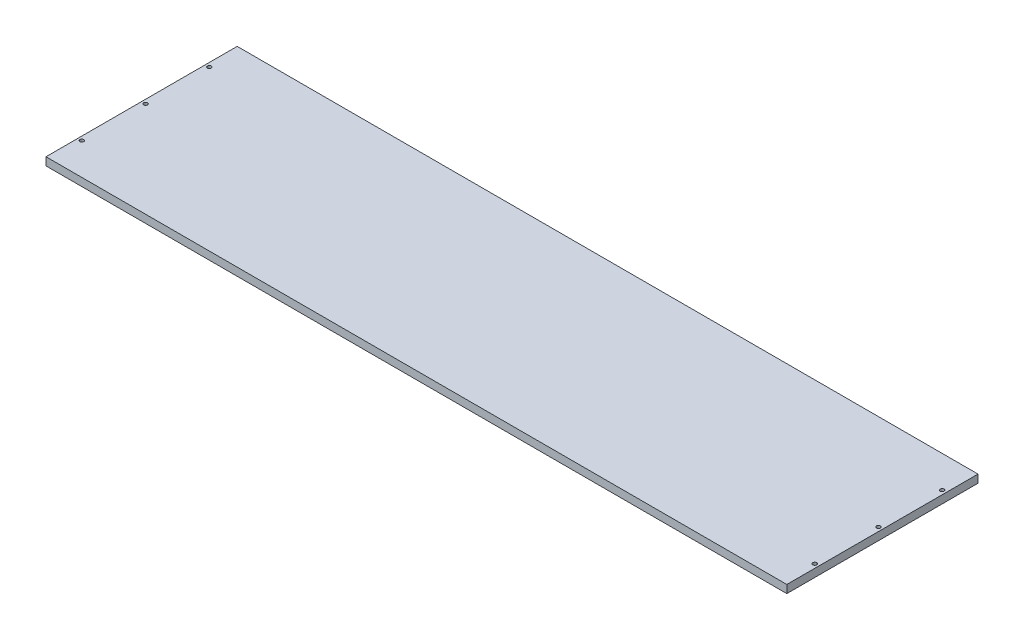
ISO-10303-21;
HEADER;
FILE_DESCRIPTION(('STEP AP214'),'2;1');
FILE_NAME('part.step','',(''),(''),'','','');
FILE_SCHEMA(('AUTOMOTIVE_DESIGN { 1 0 10303 214 1 1 1 1 }'));
ENDSEC;
DATA;
#1=APPLICATION_CONTEXT('core data for automotive mechanical design processes');
#2=APPLICATION_PROTOCOL_DEFINITION('international standard','automotive_design',2000,#1);
#3=PRODUCT_CONTEXT('',#1,'mechanical');
#4=PRODUCT('Part','Part','',(#3));
#5=PRODUCT_RELATED_PRODUCT_CATEGORY('part','',(#4));
#6=PRODUCT_DEFINITION_FORMATION('','',#4);
#7=PRODUCT_DEFINITION_CONTEXT('part definition',#1,'design');
#8=PRODUCT_DEFINITION('design','',#6,#7);
#9=PRODUCT_DEFINITION_SHAPE('','',#8);
#10=(LENGTH_UNIT() NAMED_UNIT(*) SI_UNIT(.MILLI.,.METRE.));
#11=(NAMED_UNIT(*) PLANE_ANGLE_UNIT() SI_UNIT($,.RADIAN.));
#12=(NAMED_UNIT(*) SI_UNIT($,.STERADIAN.) SOLID_ANGLE_UNIT());
#13=UNCERTAINTY_MEASURE_WITH_UNIT(LENGTH_MEASURE(1.E-05),#10,'distance_accuracy_value','');
#14=(GEOMETRIC_REPRESENTATION_CONTEXT(3) GLOBAL_UNCERTAINTY_ASSIGNED_CONTEXT((#13)) GLOBAL_UNIT_ASSIGNED_CONTEXT((#10,
#11,#12)) REPRESENTATION_CONTEXT('',''));
#15=CARTESIAN_POINT('',(0.,0.,0.));
#16=DIRECTION('',(0.,0.,1.));
#17=DIRECTION('',(1.,0.,0.));
#18=AXIS2_PLACEMENT_3D('',#15,#16,#17);
#19=CARTESIAN_POINT('',(295.275,6.35,76.2));
#20=DIRECTION('',(-1.,0.,0.));
#21=DIRECTION('',(0.,0.,1.));
#22=AXIS2_PLACEMENT_3D('',#19,#20,#21);
#23=PLANE('',#22);
#24=DIRECTION('',(0.,0.,-1.));
#25=VECTOR('',#24,1.);
#26=CARTESIAN_POINT('',(295.275,0.,76.2));
#27=LINE('',#26,#25);
#28=CARTESIAN_POINT('',(295.275,0.,76.2));
#29=VERTEX_POINT('',#28);
#30=CARTESIAN_POINT('',(295.275,0.,-76.2));
#31=VERTEX_POINT('',#30);
#32=EDGE_CURVE('E100',#29,#31,#27,.T.);
#33=ORIENTED_EDGE('',*,*,#32,.T.);
#34=DIRECTION('',(0.,-1.,0.));
#35=VECTOR('',#34,1.);
#36=CARTESIAN_POINT('',(295.275,6.35,-76.2));
#37=LINE('',#36,#35);
#38=CARTESIAN_POINT('',(295.275,6.35,-76.2));
#39=VERTEX_POINT('',#38);
#40=EDGE_CURVE('E11',#39,#31,#37,.T.);
#41=ORIENTED_EDGE('',*,*,#40,.F.);
#42=DIRECTION('',(0.,0.,-1.));
#43=VECTOR('',#42,1.);
#44=CARTESIAN_POINT('',(295.275,6.35,76.2));
#45=LINE('',#44,#43);
#46=CARTESIAN_POINT('',(295.275,6.35,76.2));
#47=VERTEX_POINT('',#46);
#48=EDGE_CURVE('E88',#47,#39,#45,.T.);
#49=ORIENTED_EDGE('',*,*,#48,.F.);
#50=DIRECTION('',(0.,-1.,0.));
#51=VECTOR('',#50,1.);
#52=CARTESIAN_POINT('',(295.275,6.35,76.2));
#53=LINE('',#52,#51);
#54=EDGE_CURVE('E96',#47,#29,#53,.T.);
#55=ORIENTED_EDGE('',*,*,#54,.T.);
#56=EDGE_LOOP('',(#33,#41,#49,#55));
#57=FACE_BOUND('',#56,.T.);
#58=ADVANCED_FACE('F37',(#57),#23,.F.);
#59=CARTESIAN_POINT('',(-295.275,6.35,-76.2));
#60=DIRECTION('',(0.,0.,1.));
#61=DIRECTION('',(1.,0.,0.));
#62=AXIS2_PLACEMENT_3D('',#59,#60,#61);
#63=PLANE('',#62);
#64=DIRECTION('',(-1.,0.,0.));
#65=VECTOR('',#64,1.);
#66=CARTESIAN_POINT('',(-295.275,0.,-76.2));
#67=LINE('',#66,#65);
#68=CARTESIAN_POINT('',(-295.275,0.,-76.2));
#69=VERTEX_POINT('',#68);
#70=EDGE_CURVE('E92',#31,#69,#67,.T.);
#71=ORIENTED_EDGE('',*,*,#70,.T.);
#72=DIRECTION('',(0.,-1.,0.));
#73=VECTOR('',#72,1.);
#74=CARTESIAN_POINT('',(-295.275,6.35,-76.2));
#75=LINE('',#74,#73);
#76=CARTESIAN_POINT('',(-295.275,6.35,-76.2));
#77=VERTEX_POINT('',#76);
#78=EDGE_CURVE('E45',#77,#69,#75,.T.);
#79=ORIENTED_EDGE('',*,*,#78,.F.);
#80=DIRECTION('',(-1.,0.,0.));
#81=VECTOR('',#80,1.);
#82=CARTESIAN_POINT('',(-295.275,6.35,-76.2));
#83=LINE('',#82,#81);
#84=EDGE_CURVE('E83',#39,#77,#83,.T.);
#85=ORIENTED_EDGE('',*,*,#84,.F.);
#86=ORIENTED_EDGE('',*,*,#40,.T.);
#87=EDGE_LOOP('',(#71,#79,#85,#86));
#88=FACE_BOUND('',#87,.T.);
#89=ADVANCED_FACE('F91',(#88),#63,.F.);
#90=CARTESIAN_POINT('',(-295.275,6.35,76.2));
#91=DIRECTION('',(1.,0.,0.));
#92=DIRECTION('',(0.,0.,-1.));
#93=AXIS2_PLACEMENT_3D('',#90,#91,#92);
#94=PLANE('',#93);
#95=DIRECTION('',(0.,0.,1.));
#96=VECTOR('',#95,1.);
#97=CARTESIAN_POINT('',(-295.275,0.,76.2));
#98=LINE('',#97,#96);
#99=CARTESIAN_POINT('',(-295.275,0.,76.2));
#100=VERTEX_POINT('',#99);
#101=EDGE_CURVE('E70',#69,#100,#98,.T.);
#102=ORIENTED_EDGE('',*,*,#101,.T.);
#103=DIRECTION('',(0.,-1.,0.));
#104=VECTOR('',#103,1.);
#105=CARTESIAN_POINT('',(-295.275,6.35,76.2));
#106=LINE('',#105,#104);
#107=CARTESIAN_POINT('',(-295.275,6.35,76.2));
#108=VERTEX_POINT('',#107);
#109=EDGE_CURVE('E93',#108,#100,#106,.T.);
#110=ORIENTED_EDGE('',*,*,#109,.F.);
#111=DIRECTION('',(0.,0.,1.));
#112=VECTOR('',#111,1.);
#113=CARTESIAN_POINT('',(-295.275,6.35,76.2));
#114=LINE('',#113,#112);
#115=EDGE_CURVE('E86',#77,#108,#114,.T.);
#116=ORIENTED_EDGE('',*,*,#115,.F.);
#117=ORIENTED_EDGE('',*,*,#78,.T.);
#118=EDGE_LOOP('',(#102,#110,#116,#117));
#119=FACE_BOUND('',#118,.T.);
#120=ADVANCED_FACE('F94',(#119),#94,.F.);
#121=CARTESIAN_POINT('',(-295.275,6.35,76.2));
#122=DIRECTION('',(0.,0.,-1.));
#123=DIRECTION('',(-1.,0.,0.));
#124=AXIS2_PLACEMENT_3D('',#121,#122,#123);
#125=PLANE('',#124);
#126=DIRECTION('',(1.,0.,0.));
#127=VECTOR('',#126,1.);
#128=CARTESIAN_POINT('',(-295.275,0.,76.2));
#129=LINE('',#128,#127);
#130=EDGE_CURVE('E76',#100,#29,#129,.T.);
#131=ORIENTED_EDGE('',*,*,#130,.T.);
#132=ORIENTED_EDGE('',*,*,#54,.F.);
#133=DIRECTION('',(1.,0.,0.));
#134=VECTOR('',#133,1.);
#135=CARTESIAN_POINT('',(-295.275,6.35,76.2));
#136=LINE('',#135,#134);
#137=EDGE_CURVE('E53',#108,#47,#136,.T.);
#138=ORIENTED_EDGE('',*,*,#137,.F.);
#139=ORIENTED_EDGE('',*,*,#109,.T.);
#140=EDGE_LOOP('',(#131,#132,#138,#139));
#141=FACE_BOUND('',#140,.T.);
#142=ADVANCED_FACE('F108',(#141),#125,.F.);
#143=CARTESIAN_POINT('',(0.,6.35,0.));
#144=DIRECTION('',(0.,-1.,0.));
#145=DIRECTION('',(0.,0.,-1.));
#146=AXIS2_PLACEMENT_3D('',#143,#144,#145);
#147=PLANE('',#146);
#148=CARTESIAN_POINT('',(-292.1,6.35,-50.8));
#149=DIRECTION('',(0.,1.,0.));
#150=DIRECTION('',(0.,0.,1.));
#151=AXIS2_PLACEMENT_3D('',#148,#149,#150);
#152=CIRCLE('',#151,1.52399999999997);
#153=CARTESIAN_POINT('',(-292.1,6.35,-49.276));
#154=VERTEX_POINT('',#153);
#155=EDGE_CURVE('E146',#154,#154,#152,.T.);
#156=ORIENTED_EDGE('',*,*,#155,.F.);
#157=EDGE_LOOP('',(#156));
#158=FACE_BOUND('',#157,.T.);
#159=CARTESIAN_POINT('',(-292.1,6.35,50.8));
#160=DIRECTION('',(0.,1.,0.));
#161=DIRECTION('',(0.,0.,1.));
#162=AXIS2_PLACEMENT_3D('',#159,#160,#161);
#163=CIRCLE('',#162,1.52399999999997);
#164=CARTESIAN_POINT('',(-292.1,6.35,52.324));
#165=VERTEX_POINT('',#164);
#166=EDGE_CURVE('E140',#165,#165,#163,.T.);
#167=ORIENTED_EDGE('',*,*,#166,.F.);
#168=EDGE_LOOP('',(#167));
#169=FACE_BOUND('',#168,.T.);
#170=CARTESIAN_POINT('',(-292.1,6.35,0.));
#171=DIRECTION('',(0.,1.,0.));
#172=DIRECTION('',(0.,0.,1.));
#173=AXIS2_PLACEMENT_3D('',#170,#171,#172);
#174=CIRCLE('',#173,1.52399999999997);
#175=CARTESIAN_POINT('',(-292.1,6.35,1.52399999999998));
#176=VERTEX_POINT('',#175);
#177=EDGE_CURVE('E134',#176,#176,#174,.T.);
#178=ORIENTED_EDGE('',*,*,#177,.F.);
#179=EDGE_LOOP('',(#178));
#180=FACE_BOUND('',#179,.T.);
#181=CARTESIAN_POINT('',(292.1,6.35,0.));
#182=DIRECTION('',(0.,1.,0.));
#183=DIRECTION('',(0.,0.,1.));
#184=AXIS2_PLACEMENT_3D('',#181,#182,#183);
#185=CIRCLE('',#184,1.52399999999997);
#186=CARTESIAN_POINT('',(292.1,6.35,1.52399999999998));
#187=VERTEX_POINT('',#186);
#188=EDGE_CURVE('E128',#187,#187,#185,.T.);
#189=ORIENTED_EDGE('',*,*,#188,.F.);
#190=EDGE_LOOP('',(#189));
#191=FACE_BOUND('',#190,.T.);
#192=CARTESIAN_POINT('',(292.1,6.35,-50.8));
#193=DIRECTION('',(0.,1.,0.));
#194=DIRECTION('',(0.,0.,1.));
#195=AXIS2_PLACEMENT_3D('',#192,#193,#194);
#196=CIRCLE('',#195,1.52399999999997);
#197=CARTESIAN_POINT('',(292.1,6.35,-49.276));
#198=VERTEX_POINT('',#197);
#199=EDGE_CURVE('E122',#198,#198,#196,.T.);
#200=ORIENTED_EDGE('',*,*,#199,.F.);
#201=EDGE_LOOP('',(#200));
#202=FACE_BOUND('',#201,.T.);
#203=CARTESIAN_POINT('',(292.1,6.35,50.8));
#204=DIRECTION('',(0.,1.,0.));
#205=DIRECTION('',(0.,0.,1.));
#206=AXIS2_PLACEMENT_3D('',#203,#204,#205);
#207=CIRCLE('',#206,1.52399999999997);
#208=CARTESIAN_POINT('',(292.1,6.35,52.324));
#209=VERTEX_POINT('',#208);
#210=EDGE_CURVE('E116',#209,#209,#207,.T.);
#211=ORIENTED_EDGE('',*,*,#210,.F.);
#212=EDGE_LOOP('',(#211));
#213=FACE_BOUND('',#212,.T.);
#214=ORIENTED_EDGE('',*,*,#48,.T.);
#215=ORIENTED_EDGE('',*,*,#84,.T.);
#216=ORIENTED_EDGE('',*,*,#115,.T.);
#217=ORIENTED_EDGE('',*,*,#137,.T.);
#218=EDGE_LOOP('',(#214,#215,#216,#217));
#219=FACE_BOUND('',#218,.T.);
#220=ADVANCED_FACE('F84',(#158,#169,#180,#191,#202,#213,#219),#147,.F.);
#221=CARTESIAN_POINT('',(0.,0.,0.));
#222=DIRECTION('',(0.,-1.,0.));
#223=DIRECTION('',(0.,0.,-1.));
#224=AXIS2_PLACEMENT_3D('',#221,#222,#223);
#225=PLANE('',#224);
#226=CARTESIAN_POINT('',(-292.1,0.,-50.8));
#227=DIRECTION('',(0.,1.,0.));
#228=DIRECTION('',(0.,0.,1.));
#229=AXIS2_PLACEMENT_3D('',#226,#227,#228);
#230=CIRCLE('',#229,1.52399999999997);
#231=CARTESIAN_POINT('',(-292.1,0.,-49.276));
#232=VERTEX_POINT('',#231);
#233=EDGE_CURVE('E143',#232,#232,#230,.T.);
#234=ORIENTED_EDGE('',*,*,#233,.T.);
#235=EDGE_LOOP('',(#234));
#236=FACE_BOUND('',#235,.T.);
#237=CARTESIAN_POINT('',(-292.1,0.,50.8));
#238=DIRECTION('',(0.,1.,0.));
#239=DIRECTION('',(0.,0.,1.));
#240=AXIS2_PLACEMENT_3D('',#237,#238,#239);
#241=CIRCLE('',#240,1.52399999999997);
#242=CARTESIAN_POINT('',(-292.1,0.,52.324));
#243=VERTEX_POINT('',#242);
#244=EDGE_CURVE('E137',#243,#243,#241,.T.);
#245=ORIENTED_EDGE('',*,*,#244,.T.);
#246=EDGE_LOOP('',(#245));
#247=FACE_BOUND('',#246,.T.);
#248=CARTESIAN_POINT('',(-292.1,0.,0.));
#249=DIRECTION('',(0.,1.,0.));
#250=DIRECTION('',(0.,0.,1.));
#251=AXIS2_PLACEMENT_3D('',#248,#249,#250);
#252=CIRCLE('',#251,1.52399999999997);
#253=CARTESIAN_POINT('',(-292.1,0.,1.52399999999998));
#254=VERTEX_POINT('',#253);
#255=EDGE_CURVE('E131',#254,#254,#252,.T.);
#256=ORIENTED_EDGE('',*,*,#255,.T.);
#257=EDGE_LOOP('',(#256));
#258=FACE_BOUND('',#257,.T.);
#259=CARTESIAN_POINT('',(292.1,0.,0.));
#260=DIRECTION('',(0.,1.,0.));
#261=DIRECTION('',(0.,0.,1.));
#262=AXIS2_PLACEMENT_3D('',#259,#260,#261);
#263=CIRCLE('',#262,1.52399999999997);
#264=CARTESIAN_POINT('',(292.1,0.,1.52399999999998));
#265=VERTEX_POINT('',#264);
#266=EDGE_CURVE('E125',#265,#265,#263,.T.);
#267=ORIENTED_EDGE('',*,*,#266,.T.);
#268=EDGE_LOOP('',(#267));
#269=FACE_BOUND('',#268,.T.);
#270=CARTESIAN_POINT('',(292.1,0.,-50.8));
#271=DIRECTION('',(0.,1.,0.));
#272=DIRECTION('',(0.,0.,1.));
#273=AXIS2_PLACEMENT_3D('',#270,#271,#272);
#274=CIRCLE('',#273,1.52399999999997);
#275=CARTESIAN_POINT('',(292.1,0.,-49.276));
#276=VERTEX_POINT('',#275);
#277=EDGE_CURVE('E119',#276,#276,#274,.T.);
#278=ORIENTED_EDGE('',*,*,#277,.T.);
#279=EDGE_LOOP('',(#278));
#280=FACE_BOUND('',#279,.T.);
#281=CARTESIAN_POINT('',(292.1,0.,50.8));
#282=DIRECTION('',(0.,1.,0.));
#283=DIRECTION('',(0.,0.,1.));
#284=AXIS2_PLACEMENT_3D('',#281,#282,#283);
#285=CIRCLE('',#284,1.52399999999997);
#286=CARTESIAN_POINT('',(292.1,0.,52.324));
#287=VERTEX_POINT('',#286);
#288=EDGE_CURVE('E103',#287,#287,#285,.T.);
#289=ORIENTED_EDGE('',*,*,#288,.T.);
#290=EDGE_LOOP('',(#289));
#291=FACE_BOUND('',#290,.T.);
#292=ORIENTED_EDGE('',*,*,#32,.F.);
#293=ORIENTED_EDGE('',*,*,#130,.F.);
#294=ORIENTED_EDGE('',*,*,#101,.F.);
#295=ORIENTED_EDGE('',*,*,#70,.F.);
#296=EDGE_LOOP('',(#292,#293,#294,#295));
#297=FACE_BOUND('',#296,.T.);
#298=ADVANCED_FACE('F111',(#236,#247,#258,#269,#280,#291,#297),#225,.T.);
#299=CARTESIAN_POINT('',(292.1,6.35,50.8));
#300=DIRECTION('',(0.,1.,0.));
#301=DIRECTION('',(0.,0.,1.));
#302=AXIS2_PLACEMENT_3D('',#299,#300,#301);
#303=CYLINDRICAL_SURFACE('',#302,1.52399999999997);
#304=ORIENTED_EDGE('',*,*,#288,.F.);
#305=EDGE_LOOP('',(#304));
#306=FACE_BOUND('',#305,.T.);
#307=ORIENTED_EDGE('',*,*,#210,.T.);
#308=EDGE_LOOP('',(#307));
#309=FACE_BOUND('',#308,.T.);
#310=ADVANCED_FACE('F165',(#306,#309),#303,.F.);
#311=CARTESIAN_POINT('',(292.1,6.35,-50.8));
#312=DIRECTION('',(0.,1.,0.));
#313=DIRECTION('',(0.,0.,1.));
#314=AXIS2_PLACEMENT_3D('',#311,#312,#313);
#315=CYLINDRICAL_SURFACE('',#314,1.52399999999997);
#316=ORIENTED_EDGE('',*,*,#277,.F.);
#317=EDGE_LOOP('',(#316));
#318=FACE_BOUND('',#317,.T.);
#319=ORIENTED_EDGE('',*,*,#199,.T.);
#320=EDGE_LOOP('',(#319));
#321=FACE_BOUND('',#320,.T.);
#322=ADVANCED_FACE('F167',(#318,#321),#315,.F.);
#323=CARTESIAN_POINT('',(292.1,6.35,0.));
#324=DIRECTION('',(0.,1.,0.));
#325=DIRECTION('',(0.,0.,1.));
#326=AXIS2_PLACEMENT_3D('',#323,#324,#325);
#327=CYLINDRICAL_SURFACE('',#326,1.52399999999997);
#328=ORIENTED_EDGE('',*,*,#266,.F.);
#329=EDGE_LOOP('',(#328));
#330=FACE_BOUND('',#329,.T.);
#331=ORIENTED_EDGE('',*,*,#188,.T.);
#332=EDGE_LOOP('',(#331));
#333=FACE_BOUND('',#332,.T.);
#334=ADVANCED_FACE('F174',(#330,#333),#327,.F.);
#335=CARTESIAN_POINT('',(-292.1,6.35,0.));
#336=DIRECTION('',(0.,1.,0.));
#337=DIRECTION('',(0.,0.,1.));
#338=AXIS2_PLACEMENT_3D('',#335,#336,#337);
#339=CYLINDRICAL_SURFACE('',#338,1.52399999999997);
#340=ORIENTED_EDGE('',*,*,#255,.F.);
#341=EDGE_LOOP('',(#340));
#342=FACE_BOUND('',#341,.T.);
#343=ORIENTED_EDGE('',*,*,#177,.T.);
#344=EDGE_LOOP('',(#343));
#345=FACE_BOUND('',#344,.T.);
#346=ADVANCED_FACE('F224',(#342,#345),#339,.F.);
#347=CARTESIAN_POINT('',(-292.1,6.35,50.8));
#348=DIRECTION('',(0.,1.,0.));
#349=DIRECTION('',(0.,0.,1.));
#350=AXIS2_PLACEMENT_3D('',#347,#348,#349);
#351=CYLINDRICAL_SURFACE('',#350,1.52399999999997);
#352=ORIENTED_EDGE('',*,*,#244,.F.);
#353=EDGE_LOOP('',(#352));
#354=FACE_BOUND('',#353,.T.);
#355=ORIENTED_EDGE('',*,*,#166,.T.);
#356=EDGE_LOOP('',(#355));
#357=FACE_BOUND('',#356,.T.);
#358=ADVANCED_FACE('F235',(#354,#357),#351,.F.);
#359=CARTESIAN_POINT('',(-292.1,6.35,-50.8));
#360=DIRECTION('',(0.,1.,0.));
#361=DIRECTION('',(0.,0.,1.));
#362=AXIS2_PLACEMENT_3D('',#359,#360,#361);
#363=CYLINDRICAL_SURFACE('',#362,1.52399999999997);
#364=ORIENTED_EDGE('',*,*,#233,.F.);
#365=EDGE_LOOP('',(#364));
#366=FACE_BOUND('',#365,.T.);
#367=ORIENTED_EDGE('',*,*,#155,.T.);
#368=EDGE_LOOP('',(#367));
#369=FACE_BOUND('',#368,.T.);
#370=ADVANCED_FACE('F150',(#366,#369),#363,.F.);
#371=CLOSED_SHELL('',(#58,#89,#120,#142,#220,#298,#310,#322,#334,#346,#358,#370));
#372=MANIFOLD_SOLID_BREP('B2',#371);
#373=ADVANCED_BREP_SHAPE_REPRESENTATION('',(#18,#372),#14);
#374=SHAPE_DEFINITION_REPRESENTATION(#9,#373);
ENDSEC;
END-ISO-10303-21;
